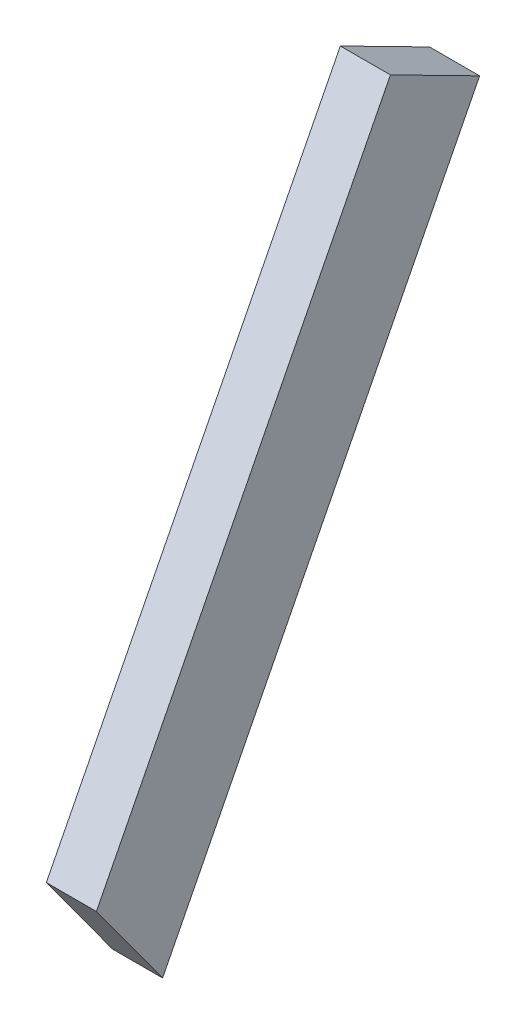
from build123d import *

# Parameters (mm, degrees)
EXTRUSION1_DEPTH = 5


with BuildPart() as part:
    # Esquisse1 → Extrusion1 (new body)
    with BuildSketch(Plane.ZY):
        Polygon((-38.210521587, 70.417249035), (-29.298872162, 74.954043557), (0.059528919, 17.285181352), (-6.55047328, 8.227249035), align=None)
    extrude(amount=EXTRUSION1_DEPTH)


solid = part.part
